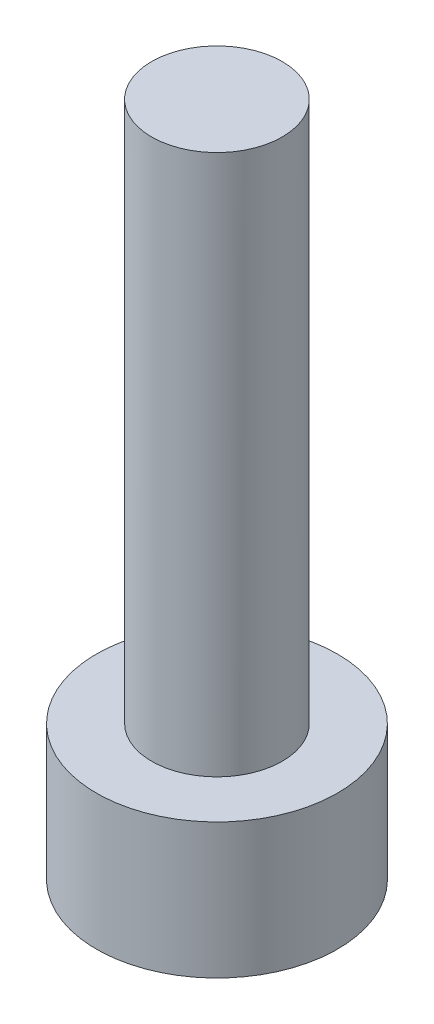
ISO-10303-21;
HEADER;
FILE_DESCRIPTION(('STEP AP214'),'2;1');
FILE_NAME('part.step','',(''),(''),'','','');
FILE_SCHEMA(('AUTOMOTIVE_DESIGN { 1 0 10303 214 1 1 1 1 }'));
ENDSEC;
DATA;
#1=APPLICATION_CONTEXT('core data for automotive mechanical design processes');
#2=APPLICATION_PROTOCOL_DEFINITION('international standard','automotive_design',2000,#1);
#3=PRODUCT_CONTEXT('',#1,'mechanical');
#4=PRODUCT('Part','Part','',(#3));
#5=PRODUCT_RELATED_PRODUCT_CATEGORY('part','',(#4));
#6=PRODUCT_DEFINITION_FORMATION('','',#4);
#7=PRODUCT_DEFINITION_CONTEXT('part definition',#1,'design');
#8=PRODUCT_DEFINITION('design','',#6,#7);
#9=PRODUCT_DEFINITION_SHAPE('','',#8);
#10=(LENGTH_UNIT() NAMED_UNIT(*) SI_UNIT(.MILLI.,.METRE.));
#11=(NAMED_UNIT(*) PLANE_ANGLE_UNIT() SI_UNIT($,.RADIAN.));
#12=(NAMED_UNIT(*) SI_UNIT($,.STERADIAN.) SOLID_ANGLE_UNIT());
#13=UNCERTAINTY_MEASURE_WITH_UNIT(LENGTH_MEASURE(1.E-05),#10,'distance_accuracy_value','');
#14=(GEOMETRIC_REPRESENTATION_CONTEXT(3) GLOBAL_UNCERTAINTY_ASSIGNED_CONTEXT((#13)) GLOBAL_UNIT_ASSIGNED_CONTEXT((#10,
#11,#12)) REPRESENTATION_CONTEXT('',''));
#15=CARTESIAN_POINT('',(0.,0.,0.));
#16=DIRECTION('',(0.,0.,1.));
#17=DIRECTION('',(1.,0.,0.));
#18=AXIS2_PLACEMENT_3D('',#15,#16,#17);
#19=CARTESIAN_POINT('',(0.,12.,0.));
#20=DIRECTION('',(0.,-1.,0.));
#21=DIRECTION('',(0.,0.,-1.));
#22=AXIS2_PLACEMENT_3D('',#19,#20,#21);
#23=CYLINDRICAL_SURFACE('',#22,1.45);
#24=CARTESIAN_POINT('',(0.,12.,0.));
#25=DIRECTION('',(0.,1.,0.));
#26=DIRECTION('',(0.,0.,1.));
#27=AXIS2_PLACEMENT_3D('',#24,#25,#26);
#28=CIRCLE('',#27,1.45);
#29=CARTESIAN_POINT('',(0.,12.,1.45));
#30=VERTEX_POINT('',#29);
#31=EDGE_CURVE('E11',#30,#30,#28,.T.);
#32=ORIENTED_EDGE('',*,*,#31,.F.);
#33=EDGE_LOOP('',(#32));
#34=FACE_BOUND('',#33,.T.);
#35=CARTESIAN_POINT('',(0.,0.,0.));
#36=DIRECTION('',(0.,-1.,0.));
#37=DIRECTION('',(0.,0.,-1.));
#38=AXIS2_PLACEMENT_3D('',#35,#36,#37);
#39=CIRCLE('',#38,1.45);
#40=CARTESIAN_POINT('',(0.,0.,-1.45));
#41=VERTEX_POINT('',#40);
#42=EDGE_CURVE('E41',#41,#41,#39,.T.);
#43=ORIENTED_EDGE('',*,*,#42,.F.);
#44=EDGE_LOOP('',(#43));
#45=FACE_BOUND('',#44,.T.);
#46=ADVANCED_FACE('F34',(#34,#45),#23,.T.);
#47=CARTESIAN_POINT('',(0.,12.,0.));
#48=DIRECTION('',(0.,1.,0.));
#49=DIRECTION('',(0.,0.,1.));
#50=AXIS2_PLACEMENT_3D('',#47,#48,#49);
#51=PLANE('',#50);
#52=ORIENTED_EDGE('',*,*,#31,.T.);
#53=EDGE_LOOP('',(#52));
#54=FACE_BOUND('',#53,.T.);
#55=ADVANCED_FACE('F151',(#54),#51,.T.);
#56=CARTESIAN_POINT('',(0.,0.,0.));
#57=DIRECTION('',(0.,-1.,0.));
#58=DIRECTION('',(0.,0.,-1.));
#59=AXIS2_PLACEMENT_3D('',#56,#57,#58);
#60=PLANE('',#59);
#61=CARTESIAN_POINT('',(0.,0.,0.));
#62=DIRECTION('',(0.,-1.,0.));
#63=DIRECTION('',(0.,0.,-1.));
#64=AXIS2_PLACEMENT_3D('',#61,#62,#63);
#65=CIRCLE('',#64,2.675);
#66=CARTESIAN_POINT('',(0.,0.,-2.675));
#67=VERTEX_POINT('',#66);
#68=EDGE_CURVE('E135',#67,#67,#65,.T.);
#69=ORIENTED_EDGE('',*,*,#68,.F.);
#70=EDGE_LOOP('',(#69));
#71=FACE_BOUND('',#70,.T.);
#72=ORIENTED_EDGE('',*,*,#42,.T.);
#73=EDGE_LOOP('',(#72));
#74=FACE_BOUND('',#73,.T.);
#75=ADVANCED_FACE('F148',(#71,#74),#60,.F.);
#76=CARTESIAN_POINT('',(0.,-3.,0.));
#77=DIRECTION('',(0.,1.,0.));
#78=DIRECTION('',(0.,0.,1.));
#79=AXIS2_PLACEMENT_3D('',#76,#77,#78);
#80=CYLINDRICAL_SURFACE('',#79,2.675);
#81=CARTESIAN_POINT('',(0.,-3.,0.));
#82=DIRECTION('',(0.,-1.,0.));
#83=DIRECTION('',(0.,0.,-1.));
#84=AXIS2_PLACEMENT_3D('',#81,#82,#83);
#85=CIRCLE('',#84,2.675);
#86=CARTESIAN_POINT('',(0.,-3.,-2.675));
#87=VERTEX_POINT('',#86);
#88=EDGE_CURVE('E141',#87,#87,#85,.T.);
#89=ORIENTED_EDGE('',*,*,#88,.F.);
#90=EDGE_LOOP('',(#89));
#91=FACE_BOUND('',#90,.T.);
#92=ORIENTED_EDGE('',*,*,#68,.T.);
#93=EDGE_LOOP('',(#92));
#94=FACE_BOUND('',#93,.T.);
#95=ADVANCED_FACE('F161',(#91,#94),#80,.T.);
#96=CARTESIAN_POINT('',(0.,-3.,0.));
#97=DIRECTION('',(0.,-1.,0.));
#98=DIRECTION('',(0.,0.,-1.));
#99=AXIS2_PLACEMENT_3D('',#96,#97,#98);
#100=PLANE('',#99);
#101=DIRECTION('',(0.23586840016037,0.,0.971785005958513));
#102=VECTOR('',#101,1.);
#103=CARTESIAN_POINT('',(1.25340948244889,-3.,-1.19539310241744));
#104=LINE('',#103,#102);
#105=CARTESIAN_POINT('',(1.25340948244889,-3.,-1.19539310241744));
#106=VERTEX_POINT('',#105);
#107=CARTESIAN_POINT('',(1.66194553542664,-3.,0.487787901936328));
#108=VERTEX_POINT('',#107);
#109=EDGE_CURVE('E48',#106,#108,#104,.T.);
#110=ORIENTED_EDGE('',*,*,#109,.F.);
#111=DIRECTION('',(0.95952470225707,0.,0.281624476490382));
#112=VECTOR('',#111,1.);
#113=CARTESIAN_POINT('',(-0.408536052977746,-3.,-1.68318100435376));
#114=LINE('',#113,#112);
#115=CARTESIAN_POINT('',(-0.408536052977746,-3.,-1.68318100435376));
#116=VERTEX_POINT('',#115);
#117=EDGE_CURVE('E131',#116,#106,#114,.T.);
#118=ORIENTED_EDGE('',*,*,#117,.F.);
#119=DIRECTION('',(0.723656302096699,0.,-0.690160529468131));
#120=VECTOR('',#119,1.);
#121=CARTESIAN_POINT('',(-1.66194553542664,-3.,-0.487787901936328));
#122=LINE('',#121,#120);
#123=CARTESIAN_POINT('',(-1.66194553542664,-3.,-0.487787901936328));
#124=VERTEX_POINT('',#123);
#125=EDGE_CURVE('E129',#124,#116,#122,.T.);
#126=ORIENTED_EDGE('',*,*,#125,.F.);
#127=DIRECTION('',(-0.23586840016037,0.,-0.971785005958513));
#128=VECTOR('',#127,1.);
#129=CARTESIAN_POINT('',(-1.25340948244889,-3.,1.19539310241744));
#130=LINE('',#129,#128);
#131=CARTESIAN_POINT('',(-1.25340948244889,-3.,1.19539310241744));
#132=VERTEX_POINT('',#131);
#133=EDGE_CURVE('E96',#132,#124,#130,.T.);
#134=ORIENTED_EDGE('',*,*,#133,.F.);
#135=DIRECTION('',(-0.95952470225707,0.,-0.281624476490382));
#136=VECTOR('',#135,1.);
#137=CARTESIAN_POINT('',(0.408536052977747,-3.,1.68318100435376));
#138=LINE('',#137,#136);
#139=CARTESIAN_POINT('',(0.408536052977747,-3.,1.68318100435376));
#140=VERTEX_POINT('',#139);
#141=EDGE_CURVE('E125',#140,#132,#138,.T.);
#142=ORIENTED_EDGE('',*,*,#141,.F.);
#143=DIRECTION('',(-0.723656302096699,0.,0.690160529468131));
#144=VECTOR('',#143,1.);
#145=CARTESIAN_POINT('',(1.66194553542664,-3.,0.487787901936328));
#146=LINE('',#145,#144);
#147=EDGE_CURVE('E122',#108,#140,#146,.T.);
#148=ORIENTED_EDGE('',*,*,#147,.F.);
#149=EDGE_LOOP('',(#110,#118,#126,#134,#142,#148));
#150=FACE_BOUND('',#149,.T.);
#151=ORIENTED_EDGE('',*,*,#88,.T.);
#152=EDGE_LOOP('',(#151));
#153=FACE_BOUND('',#152,.T.);
#154=ADVANCED_FACE('F166',(#150,#153),#100,.T.);
#155=CARTESIAN_POINT('',(1.25340948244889,-1.,-1.19539310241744));
#156=DIRECTION('',(0.971785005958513,0.,-0.23586840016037));
#157=DIRECTION('',(-0.23586840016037,0.,-0.971785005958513));
#158=AXIS2_PLACEMENT_3D('',#155,#156,#157);
#159=PLANE('',#158);
#160=ORIENTED_EDGE('',*,*,#109,.T.);
#161=DIRECTION('',(0.,-1.,0.));
#162=VECTOR('',#161,1.);
#163=CARTESIAN_POINT('',(1.66194553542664,-1.,0.487787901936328));
#164=LINE('',#163,#162);
#165=CARTESIAN_POINT('',(1.66194553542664,-1.,0.487787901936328));
#166=VERTEX_POINT('',#165);
#167=EDGE_CURVE('E78',#166,#108,#164,.T.);
#168=ORIENTED_EDGE('',*,*,#167,.F.);
#169=DIRECTION('',(0.23586840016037,0.,0.971785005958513));
#170=VECTOR('',#169,1.);
#171=CARTESIAN_POINT('',(1.25340948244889,-1.,-1.19539310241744));
#172=LINE('',#171,#170);
#173=CARTESIAN_POINT('',(1.25340948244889,-1.,-1.19539310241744));
#174=VERTEX_POINT('',#173);
#175=EDGE_CURVE('E133',#174,#166,#172,.T.);
#176=ORIENTED_EDGE('',*,*,#175,.F.);
#177=DIRECTION('',(0.,-1.,0.));
#178=VECTOR('',#177,1.);
#179=CARTESIAN_POINT('',(1.25340948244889,-1.,-1.19539310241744));
#180=LINE('',#179,#178);
#181=EDGE_CURVE('E56',#174,#106,#180,.T.);
#182=ORIENTED_EDGE('',*,*,#181,.T.);
#183=EDGE_LOOP('',(#160,#168,#176,#182));
#184=FACE_BOUND('',#183,.T.);
#185=ADVANCED_FACE('F171',(#184),#159,.F.);
#186=CARTESIAN_POINT('',(-0.408536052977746,-1.,-1.68318100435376));
#187=DIRECTION('',(0.281624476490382,0.,-0.95952470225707));
#188=DIRECTION('',(-0.95952470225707,0.,-0.281624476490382));
#189=AXIS2_PLACEMENT_3D('',#186,#187,#188);
#190=PLANE('',#189);
#191=ORIENTED_EDGE('',*,*,#117,.T.);
#192=ORIENTED_EDGE('',*,*,#181,.F.);
#193=DIRECTION('',(0.95952470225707,0.,0.281624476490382));
#194=VECTOR('',#193,1.);
#195=CARTESIAN_POINT('',(-0.408536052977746,-1.,-1.68318100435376));
#196=LINE('',#195,#194);
#197=CARTESIAN_POINT('',(-0.408536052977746,-1.,-1.68318100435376));
#198=VERTEX_POINT('',#197);
#199=EDGE_CURVE('E108',#198,#174,#196,.T.);
#200=ORIENTED_EDGE('',*,*,#199,.F.);
#201=DIRECTION('',(0.,-1.,0.));
#202=VECTOR('',#201,1.);
#203=CARTESIAN_POINT('',(-0.408536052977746,-1.,-1.68318100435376));
#204=LINE('',#203,#202);
#205=EDGE_CURVE('E100',#198,#116,#204,.T.);
#206=ORIENTED_EDGE('',*,*,#205,.T.);
#207=EDGE_LOOP('',(#191,#192,#200,#206));
#208=FACE_BOUND('',#207,.T.);
#209=ADVANCED_FACE('F175',(#208),#190,.F.);
#210=CARTESIAN_POINT('',(-1.66194553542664,-1.,-0.487787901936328));
#211=DIRECTION('',(-0.690160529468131,0.,-0.723656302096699));
#212=DIRECTION('',(-0.723656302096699,0.,0.690160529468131));
#213=AXIS2_PLACEMENT_3D('',#210,#211,#212);
#214=PLANE('',#213);
#215=ORIENTED_EDGE('',*,*,#125,.T.);
#216=ORIENTED_EDGE('',*,*,#205,.F.);
#217=DIRECTION('',(0.723656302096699,0.,-0.690160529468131));
#218=VECTOR('',#217,1.);
#219=CARTESIAN_POINT('',(-1.66194553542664,-1.,-0.487787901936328));
#220=LINE('',#219,#218);
#221=CARTESIAN_POINT('',(-1.66194553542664,-1.,-0.487787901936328));
#222=VERTEX_POINT('',#221);
#223=EDGE_CURVE('E104',#222,#198,#220,.T.);
#224=ORIENTED_EDGE('',*,*,#223,.F.);
#225=DIRECTION('',(0.,-1.,0.));
#226=VECTOR('',#225,1.);
#227=CARTESIAN_POINT('',(-1.66194553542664,-1.,-0.487787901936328));
#228=LINE('',#227,#226);
#229=EDGE_CURVE('E89',#222,#124,#228,.T.);
#230=ORIENTED_EDGE('',*,*,#229,.T.);
#231=EDGE_LOOP('',(#215,#216,#224,#230));
#232=FACE_BOUND('',#231,.T.);
#233=ADVANCED_FACE('F105',(#232),#214,.F.);
#234=CARTESIAN_POINT('',(-1.25340948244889,-1.,1.19539310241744));
#235=DIRECTION('',(-0.971785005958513,0.,0.23586840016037));
#236=DIRECTION('',(0.23586840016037,0.,0.971785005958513));
#237=AXIS2_PLACEMENT_3D('',#234,#235,#236);
#238=PLANE('',#237);
#239=ORIENTED_EDGE('',*,*,#133,.T.);
#240=ORIENTED_EDGE('',*,*,#229,.F.);
#241=DIRECTION('',(-0.23586840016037,0.,-0.971785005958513));
#242=VECTOR('',#241,1.);
#243=CARTESIAN_POINT('',(-1.25340948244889,-1.,1.19539310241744));
#244=LINE('',#243,#242);
#245=CARTESIAN_POINT('',(-1.25340948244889,-1.,1.19539310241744));
#246=VERTEX_POINT('',#245);
#247=EDGE_CURVE('E93',#246,#222,#244,.T.);
#248=ORIENTED_EDGE('',*,*,#247,.F.);
#249=DIRECTION('',(0.,-1.,0.));
#250=VECTOR('',#249,1.);
#251=CARTESIAN_POINT('',(-1.25340948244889,-1.,1.19539310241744));
#252=LINE('',#251,#250);
#253=EDGE_CURVE('E101',#246,#132,#252,.T.);
#254=ORIENTED_EDGE('',*,*,#253,.T.);
#255=EDGE_LOOP('',(#239,#240,#248,#254));
#256=FACE_BOUND('',#255,.T.);
#257=ADVANCED_FACE('F91',(#256),#238,.F.);
#258=CARTESIAN_POINT('',(0.408536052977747,-1.,1.68318100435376));
#259=DIRECTION('',(-0.281624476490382,0.,0.95952470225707));
#260=DIRECTION('',(0.95952470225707,0.,0.281624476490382));
#261=AXIS2_PLACEMENT_3D('',#258,#259,#260);
#262=PLANE('',#261);
#263=ORIENTED_EDGE('',*,*,#141,.T.);
#264=ORIENTED_EDGE('',*,*,#253,.F.);
#265=DIRECTION('',(-0.95952470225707,0.,-0.281624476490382));
#266=VECTOR('',#265,1.);
#267=CARTESIAN_POINT('',(0.408536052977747,-1.,1.68318100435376));
#268=LINE('',#267,#266);
#269=CARTESIAN_POINT('',(0.408536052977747,-1.,1.68318100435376));
#270=VERTEX_POINT('',#269);
#271=EDGE_CURVE('E114',#270,#246,#268,.T.);
#272=ORIENTED_EDGE('',*,*,#271,.F.);
#273=DIRECTION('',(0.,-1.,0.));
#274=VECTOR('',#273,1.);
#275=CARTESIAN_POINT('',(0.408536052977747,-1.,1.68318100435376));
#276=LINE('',#275,#274);
#277=EDGE_CURVE('E138',#270,#140,#276,.T.);
#278=ORIENTED_EDGE('',*,*,#277,.T.);
#279=EDGE_LOOP('',(#263,#264,#272,#278));
#280=FACE_BOUND('',#279,.T.);
#281=ADVANCED_FACE('F179',(#280),#262,.F.);
#282=CARTESIAN_POINT('',(1.66194553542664,-1.,0.487787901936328));
#283=DIRECTION('',(0.690160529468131,0.,0.723656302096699));
#284=DIRECTION('',(0.723656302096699,0.,-0.690160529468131));
#285=AXIS2_PLACEMENT_3D('',#282,#283,#284);
#286=PLANE('',#285);
#287=ORIENTED_EDGE('',*,*,#147,.T.);
#288=ORIENTED_EDGE('',*,*,#277,.F.);
#289=DIRECTION('',(-0.723656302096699,0.,0.690160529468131));
#290=VECTOR('',#289,1.);
#291=CARTESIAN_POINT('',(1.66194553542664,-1.,0.487787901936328));
#292=LINE('',#291,#290);
#293=EDGE_CURVE('E116',#166,#270,#292,.T.);
#294=ORIENTED_EDGE('',*,*,#293,.F.);
#295=ORIENTED_EDGE('',*,*,#167,.T.);
#296=EDGE_LOOP('',(#287,#288,#294,#295));
#297=FACE_BOUND('',#296,.T.);
#298=ADVANCED_FACE('F176',(#297),#286,.F.);
#299=CARTESIAN_POINT('',(0.,-1.,0.));
#300=DIRECTION('',(0.,-1.,0.));
#301=DIRECTION('',(0.,0.,-1.));
#302=AXIS2_PLACEMENT_3D('',#299,#300,#301);
#303=PLANE('',#302);
#304=ORIENTED_EDGE('',*,*,#175,.T.);
#305=ORIENTED_EDGE('',*,*,#293,.T.);
#306=ORIENTED_EDGE('',*,*,#271,.T.);
#307=ORIENTED_EDGE('',*,*,#247,.T.);
#308=ORIENTED_EDGE('',*,*,#223,.T.);
#309=ORIENTED_EDGE('',*,*,#199,.T.);
#310=EDGE_LOOP('',(#304,#305,#306,#307,#308,#309));
#311=FACE_BOUND('',#310,.T.);
#312=ADVANCED_FACE('F111',(#311),#303,.T.);
#313=CLOSED_SHELL('',(#46,#55,#75,#95,#154,#185,#209,#233,#257,#281,#298,#312));
#314=MANIFOLD_SOLID_BREP('B2',#313);
#315=ADVANCED_BREP_SHAPE_REPRESENTATION('',(#18,#314),#14);
#316=SHAPE_DEFINITION_REPRESENTATION(#9,#315);
ENDSEC;
END-ISO-10303-21;
